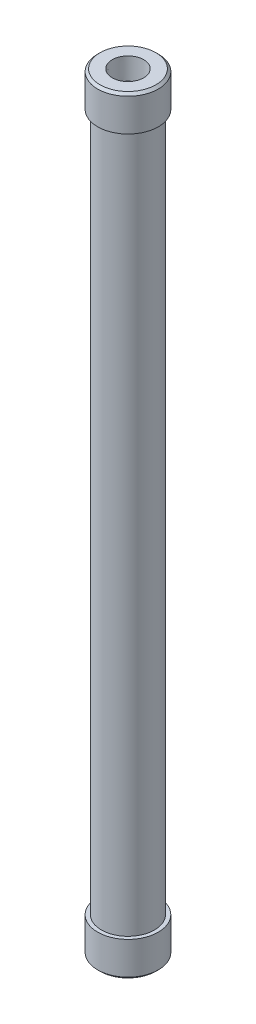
ISO-10303-21;
HEADER;
FILE_DESCRIPTION(('STEP AP214'),'2;1');
FILE_NAME('part.step','',(''),(''),'','','');
FILE_SCHEMA(('AUTOMOTIVE_DESIGN { 1 0 10303 214 1 1 1 1 }'));
ENDSEC;
DATA;
#1=APPLICATION_CONTEXT('core data for automotive mechanical design processes');
#2=APPLICATION_PROTOCOL_DEFINITION('international standard','automotive_design',2000,#1);
#3=PRODUCT_CONTEXT('',#1,'mechanical');
#4=PRODUCT('Part','Part','',(#3));
#5=PRODUCT_RELATED_PRODUCT_CATEGORY('part','',(#4));
#6=PRODUCT_DEFINITION_FORMATION('','',#4);
#7=PRODUCT_DEFINITION_CONTEXT('part definition',#1,'design');
#8=PRODUCT_DEFINITION('design','',#6,#7);
#9=PRODUCT_DEFINITION_SHAPE('','',#8);
#10=(LENGTH_UNIT() NAMED_UNIT(*) SI_UNIT(.MILLI.,.METRE.));
#11=(NAMED_UNIT(*) PLANE_ANGLE_UNIT() SI_UNIT($,.RADIAN.));
#12=(NAMED_UNIT(*) SI_UNIT($,.STERADIAN.) SOLID_ANGLE_UNIT());
#13=UNCERTAINTY_MEASURE_WITH_UNIT(LENGTH_MEASURE(1.E-05),#10,'distance_accuracy_value','');
#14=(GEOMETRIC_REPRESENTATION_CONTEXT(3) GLOBAL_UNCERTAINTY_ASSIGNED_CONTEXT((#13)) GLOBAL_UNIT_ASSIGNED_CONTEXT((#10,
#11,#12)) REPRESENTATION_CONTEXT('',''));
#15=CARTESIAN_POINT('',(0.,0.,0.));
#16=DIRECTION('',(0.,0.,1.));
#17=DIRECTION('',(1.,0.,0.));
#18=AXIS2_PLACEMENT_3D('',#15,#16,#17);
#19=CARTESIAN_POINT('',(0.,482.6,0.));
#20=DIRECTION('',(0.,-1.,0.));
#21=DIRECTION('',(0.,0.,-1.));
#22=AXIS2_PLACEMENT_3D('',#19,#20,#21);
#23=CYLINDRICAL_SURFACE('',#22,16.7005);
#24=CARTESIAN_POINT('',(0.,22.098,0.));
#25=DIRECTION('',(0.,1.,0.));
#26=DIRECTION('',(0.,0.,1.));
#27=AXIS2_PLACEMENT_3D('',#24,#25,#26);
#28=CIRCLE('',#27,16.7005);
#29=CARTESIAN_POINT('',(0.,22.0979999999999,-16.7005));
#30=VERTEX_POINT('',#29);
#31=EDGE_CURVE('E70',#30,#30,#28,.T.);
#32=CARTESIAN_POINT('',(0.,460.502,0.));
#33=DIRECTION('',(0.,1.,0.));
#34=DIRECTION('',(0.,0.,1.));
#35=AXIS2_PLACEMENT_3D('',#32,#33,#34);
#36=CIRCLE('',#35,16.7005);
#37=CARTESIAN_POINT('',(0.,460.502,-16.7005));
#38=VERTEX_POINT('',#37);
#39=EDGE_CURVE('E52',#38,#38,#36,.T.);
#40=CARTESIAN_POINT('',(0.,22.0979999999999,-16.7005));
#41=CARTESIAN_POINT('',(0.,26.6647083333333,-16.7005));
#42=CARTESIAN_POINT('',(0.,31.2314166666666,-16.7005));
#43=CARTESIAN_POINT('',(0.,40.3648333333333,-16.7005));
#44=CARTESIAN_POINT('',(0.,44.9315416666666,-16.7005));
#45=CARTESIAN_POINT('',(0.,54.0649583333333,-16.7005));
#46=CARTESIAN_POINT('',(0.,58.6316666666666,-16.7005));
#47=CARTESIAN_POINT('',(0.,67.7650833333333,-16.7005));
#48=CARTESIAN_POINT('',(0.,72.3317916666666,-16.7005));
#49=CARTESIAN_POINT('',(0.,81.4652083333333,-16.7005));
#50=CARTESIAN_POINT('',(0.,86.0319166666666,-16.7005));
#51=CARTESIAN_POINT('',(0.,95.1653333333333,-16.7005));
#52=CARTESIAN_POINT('',(0.,99.7320416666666,-16.7005));
#53=CARTESIAN_POINT('',(0.,108.865458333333,-16.7005));
#54=CARTESIAN_POINT('',(0.,113.432166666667,-16.7005));
#55=CARTESIAN_POINT('',(0.,122.565583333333,-16.7005));
#56=CARTESIAN_POINT('',(0.,127.132291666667,-16.7005));
#57=CARTESIAN_POINT('',(0.,136.265708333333,-16.7005));
#58=CARTESIAN_POINT('',(0.,140.832416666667,-16.7005));
#59=CARTESIAN_POINT('',(0.,149.965833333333,-16.7005));
#60=CARTESIAN_POINT('',(0.,154.532541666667,-16.7005));
#61=CARTESIAN_POINT('',(0.,163.665958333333,-16.7005));
#62=CARTESIAN_POINT('',(0.,168.232666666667,-16.7005));
#63=CARTESIAN_POINT('',(0.,177.366083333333,-16.7005));
#64=CARTESIAN_POINT('',(0.,181.932791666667,-16.7005));
#65=CARTESIAN_POINT('',(0.,191.066208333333,-16.7005));
#66=CARTESIAN_POINT('',(0.,195.632916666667,-16.7005));
#67=CARTESIAN_POINT('',(0.,204.766333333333,-16.7005));
#68=CARTESIAN_POINT('',(0.,209.333041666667,-16.7005));
#69=CARTESIAN_POINT('',(0.,218.466458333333,-16.7005));
#70=CARTESIAN_POINT('',(0.,223.033166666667,-16.7005));
#71=CARTESIAN_POINT('',(0.,232.166583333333,-16.7005));
#72=CARTESIAN_POINT('',(0.,236.733291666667,-16.7005));
#73=CARTESIAN_POINT('',(0.,245.866708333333,-16.7005));
#74=CARTESIAN_POINT('',(0.,250.433416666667,-16.7005));
#75=CARTESIAN_POINT('',(0.,259.566833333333,-16.7005));
#76=CARTESIAN_POINT('',(0.,264.133541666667,-16.7005));
#77=CARTESIAN_POINT('',(0.,273.266958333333,-16.7005));
#78=CARTESIAN_POINT('',(0.,277.833666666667,-16.7005));
#79=CARTESIAN_POINT('',(0.,286.967083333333,-16.7005));
#80=CARTESIAN_POINT('',(0.,291.533791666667,-16.7005));
#81=CARTESIAN_POINT('',(0.,300.667208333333,-16.7005));
#82=CARTESIAN_POINT('',(0.,305.233916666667,-16.7005));
#83=CARTESIAN_POINT('',(0.,314.367333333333,-16.7005));
#84=CARTESIAN_POINT('',(0.,318.934041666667,-16.7005));
#85=CARTESIAN_POINT('',(0.,328.067458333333,-16.7005));
#86=CARTESIAN_POINT('',(0.,332.634166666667,-16.7005));
#87=CARTESIAN_POINT('',(0.,341.767583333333,-16.7005));
#88=CARTESIAN_POINT('',(0.,346.334291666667,-16.7005));
#89=CARTESIAN_POINT('',(0.,355.467708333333,-16.7005));
#90=CARTESIAN_POINT('',(0.,360.034416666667,-16.7005));
#91=CARTESIAN_POINT('',(0.,369.167833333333,-16.7005));
#92=CARTESIAN_POINT('',(0.,373.734541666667,-16.7005));
#93=CARTESIAN_POINT('',(0.,382.867958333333,-16.7005));
#94=CARTESIAN_POINT('',(0.,387.434666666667,-16.7005));
#95=CARTESIAN_POINT('',(0.,396.568083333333,-16.7005));
#96=CARTESIAN_POINT('',(0.,401.134791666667,-16.7005));
#97=CARTESIAN_POINT('',(0.,410.268208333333,-16.7005));
#98=CARTESIAN_POINT('',(0.,414.834916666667,-16.7005));
#99=CARTESIAN_POINT('',(0.,423.968333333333,-16.7005));
#100=CARTESIAN_POINT('',(0.,428.535041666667,-16.7005));
#101=CARTESIAN_POINT('',(0.,437.668458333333,-16.7005));
#102=CARTESIAN_POINT('',(0.,442.235166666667,-16.7005));
#103=CARTESIAN_POINT('',(0.,451.368583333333,-16.7005));
#104=CARTESIAN_POINT('',(0.,455.935291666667,-16.7005));
#105=CARTESIAN_POINT('',(0.,460.502,-16.7005));
#106=B_SPLINE_CURVE_WITH_KNOTS('',3,(#40,#41,#42,#43,#44,#45,#46,#47,#48,#49,#50,#51,#52,#53,
#54,#55,#56,#57,#58,#59,#60,#61,#62,#63,#64,#65,#66,#67,#68,#69,#70,#71,#72,#73,#74,#75,#76,#77,
#78,#79,#80,#81,#82,#83,#84,#85,#86,#87,#88,#89,#90,#91,#92,#93,#94,#95,#96,#97,#98,#99,#100,
#101,#102,#103,#104,#105),.UNSPECIFIED.,.F.,.F.,(4,2,2,2,2,2,2,2,2,2,2,2,2,2,2,2,2,2,2,2,2,2,2,
2,2,2,2,2,2,2,2,2,4),(0.,13.700125,27.40025,41.100375,54.8005,68.500625,82.20075,95.900875,
109.601,123.301125,137.00125,150.701375,164.4015,178.101625,191.80175,205.501875,219.202,
232.902125,246.60225,260.302375,274.0025,287.702625,301.40275,315.102875,328.803,342.503125,
356.20325,369.903375,383.6035,397.303625,411.00375,424.703875,438.404),.UNSPECIFIED.);
#107=EDGE_CURVE('BSEAM32',#30,#38,#106,.T.);
#108=ORIENTED_EDGE('',*,*,#31,.T.);
#109=ORIENTED_EDGE('',*,*,#39,.F.);
#110=ORIENTED_EDGE('',*,*,#107,.T.);
#111=ORIENTED_EDGE('',*,*,#107,.F.);
#112=EDGE_LOOP('',(#108,#110,#109,#111));
#113=FACE_BOUND('',#112,.T.);
#114=ADVANCED_FACE('F32',(#113),#23,.T.);
#115=CARTESIAN_POINT('',(0.,22.098,0.));
#116=DIRECTION('',(0.,1.,0.));
#117=DIRECTION('',(0.,0.,1.));
#118=AXIS2_PLACEMENT_3D('',#115,#116,#117);
#119=PLANE('',#118);
#120=CARTESIAN_POINT('',(0.,22.098,0.));
#121=DIRECTION('',(0.,1.,0.));
#122=DIRECTION('',(0.,0.,1.));
#123=AXIS2_PLACEMENT_3D('',#120,#121,#122);
#124=CIRCLE('',#123,19.05);
#125=CARTESIAN_POINT('',(0.,22.098,19.05));
#126=VERTEX_POINT('',#125);
#127=EDGE_CURVE('E66',#126,#126,#124,.T.);
#128=ORIENTED_EDGE('',*,*,#127,.T.);
#129=EDGE_LOOP('',(#128));
#130=FACE_BOUND('',#129,.T.);
#131=ORIENTED_EDGE('',*,*,#31,.F.);
#132=EDGE_LOOP('',(#131));
#133=FACE_BOUND('',#132,.T.);
#134=ADVANCED_FACE('F114',(#130,#133),#119,.T.);
#135=CARTESIAN_POINT('',(0.,22.098,0.));
#136=DIRECTION('',(0.,-1.,0.));
#137=DIRECTION('',(0.,0.,-1.));
#138=AXIS2_PLACEMENT_3D('',#135,#136,#137);
#139=CYLINDRICAL_SURFACE('',#138,19.05);
#140=CARTESIAN_POINT('',(0.,1.52400000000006,0.));
#141=DIRECTION('',(0.,1.,0.));
#142=DIRECTION('',(0.,0.,1.));
#143=AXIS2_PLACEMENT_3D('',#140,#141,#142);
#144=CIRCLE('',#143,19.05);
#145=CARTESIAN_POINT('',(0.,1.52400000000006,19.05));
#146=VERTEX_POINT('',#145);
#147=EDGE_CURVE('E47',#146,#146,#144,.T.);
#148=ORIENTED_EDGE('',*,*,#147,.T.);
#149=EDGE_LOOP('',(#148));
#150=FACE_BOUND('',#149,.T.);
#151=ORIENTED_EDGE('',*,*,#127,.F.);
#152=EDGE_LOOP('',(#151));
#153=FACE_BOUND('',#152,.T.);
#154=ADVANCED_FACE('F120',(#150,#153),#139,.T.);
#155=CARTESIAN_POINT('',(0.,0.,0.));
#156=DIRECTION('',(0.,1.,0.));
#157=DIRECTION('',(0.,0.,1.));
#158=AXIS2_PLACEMENT_3D('',#155,#156,#157);
#159=PLANE('',#158);
#160=CARTESIAN_POINT('',(0.,0.,0.));
#161=DIRECTION('',(0.,1.,0.));
#162=DIRECTION('',(0.,0.,1.));
#163=AXIS2_PLACEMENT_3D('',#160,#161,#162);
#164=CIRCLE('',#163,17.5259999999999);
#165=CARTESIAN_POINT('',(0.,0.,17.5259999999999));
#166=VERTEX_POINT('',#165);
#167=EDGE_CURVE('E43',#166,#166,#164,.F.);
#168=ORIENTED_EDGE('',*,*,#167,.T.);
#169=EDGE_LOOP('',(#168));
#170=FACE_BOUND('',#169,.T.);
#171=CARTESIAN_POINT('',(0.,0.,0.));
#172=DIRECTION('',(0.,-1.,0.));
#173=DIRECTION('',(0.,0.,-1.));
#174=AXIS2_PLACEMENT_3D('',#171,#172,#173);
#175=CIRCLE('',#174,9.8827971);
#176=CARTESIAN_POINT('',(0.,0.,-9.8827971));
#177=VERTEX_POINT('',#176);
#178=EDGE_CURVE('E56',#177,#177,#175,.T.);
#179=ORIENTED_EDGE('',*,*,#178,.F.);
#180=EDGE_LOOP('',(#179));
#181=FACE_BOUND('',#180,.T.);
#182=ADVANCED_FACE('F125',(#170,#181),#159,.F.);
#183=CARTESIAN_POINT('',(0.,460.502,0.));
#184=DIRECTION('',(0.,1.,0.));
#185=DIRECTION('',(0.,0.,1.));
#186=AXIS2_PLACEMENT_3D('',#183,#184,#185);
#187=PLANE('',#186);
#188=CARTESIAN_POINT('',(0.,460.502,0.));
#189=DIRECTION('',(0.,1.,0.));
#190=DIRECTION('',(0.,0.,1.));
#191=AXIS2_PLACEMENT_3D('',#188,#189,#190);
#192=CIRCLE('',#191,19.05);
#193=CARTESIAN_POINT('',(0.,460.502,19.05));
#194=VERTEX_POINT('',#193);
#195=EDGE_CURVE('E61',#194,#194,#192,.T.);
#196=ORIENTED_EDGE('',*,*,#195,.F.);
#197=EDGE_LOOP('',(#196));
#198=FACE_BOUND('',#197,.T.);
#199=ORIENTED_EDGE('',*,*,#39,.T.);
#200=EDGE_LOOP('',(#199));
#201=FACE_BOUND('',#200,.T.);
#202=ADVANCED_FACE('F109',(#198,#201),#187,.F.);
#203=CARTESIAN_POINT('',(0.,460.502,0.));
#204=DIRECTION('',(0.,1.,0.));
#205=DIRECTION('',(0.,0.,1.));
#206=AXIS2_PLACEMENT_3D('',#203,#204,#205);
#207=CYLINDRICAL_SURFACE('',#206,19.05);
#208=CARTESIAN_POINT('',(0.,481.076,0.));
#209=DIRECTION('',(0.,1.,0.));
#210=DIRECTION('',(0.,0.,1.));
#211=AXIS2_PLACEMENT_3D('',#208,#209,#210);
#212=CIRCLE('',#211,19.05);
#213=CARTESIAN_POINT('',(0.,481.076,-19.05));
#214=VERTEX_POINT('',#213);
#215=EDGE_CURVE('E10',#214,#214,#212,.F.);
#216=ORIENTED_EDGE('',*,*,#215,.T.);
#217=EDGE_LOOP('',(#216));
#218=FACE_BOUND('',#217,.T.);
#219=ORIENTED_EDGE('',*,*,#195,.T.);
#220=EDGE_LOOP('',(#219));
#221=FACE_BOUND('',#220,.T.);
#222=ADVANCED_FACE('F100',(#218,#221),#207,.T.);
#223=CARTESIAN_POINT('',(0.,482.6,0.));
#224=DIRECTION('',(0.,1.,0.));
#225=DIRECTION('',(0.,0.,1.));
#226=AXIS2_PLACEMENT_3D('',#223,#224,#225);
#227=PLANE('',#226);
#228=CARTESIAN_POINT('',(0.,482.6,0.));
#229=DIRECTION('',(0.,1.,0.));
#230=DIRECTION('',(0.,0.,1.));
#231=AXIS2_PLACEMENT_3D('',#228,#229,#230);
#232=CIRCLE('',#231,17.526);
#233=CARTESIAN_POINT('',(0.,482.6,-17.526));
#234=VERTEX_POINT('',#233);
#235=EDGE_CURVE('E39',#234,#234,#232,.T.);
#236=ORIENTED_EDGE('',*,*,#235,.T.);
#237=EDGE_LOOP('',(#236));
#238=FACE_BOUND('',#237,.T.);
#239=CARTESIAN_POINT('',(0.,482.6,0.));
#240=DIRECTION('',(0.,1.,0.));
#241=DIRECTION('',(0.,0.,1.));
#242=AXIS2_PLACEMENT_3D('',#239,#240,#241);
#243=CIRCLE('',#242,9.8827971);
#244=CARTESIAN_POINT('',(0.,482.6,9.8827971));
#245=VERTEX_POINT('',#244);
#246=EDGE_CURVE('E91',#245,#245,#243,.T.);
#247=ORIENTED_EDGE('',*,*,#246,.F.);
#248=EDGE_LOOP('',(#247));
#249=FACE_BOUND('',#248,.T.);
#250=ADVANCED_FACE('F97',(#238,#249),#227,.T.);
#251=CARTESIAN_POINT('',(0.,0.,0.));
#252=DIRECTION('',(0.,-1.,0.));
#253=DIRECTION('',(0.,0.,-1.));
#254=AXIS2_PLACEMENT_3D('',#251,#252,#253);
#255=CYLINDRICAL_SURFACE('',#254,8.9281);
#256=CARTESIAN_POINT('',(0.,22.098,0.));
#257=DIRECTION('',(0.,1.,0.));
#258=DIRECTION('',(0.,0.,1.));
#259=AXIS2_PLACEMENT_3D('',#256,#257,#258);
#260=CIRCLE('',#259,8.9281);
#261=CARTESIAN_POINT('',(0.,22.098,8.9281));
#262=VERTEX_POINT('',#261);
#263=EDGE_CURVE('E58',#262,#262,#260,.T.);
#264=ORIENTED_EDGE('',*,*,#263,.T.);
#265=EDGE_LOOP('',(#264));
#266=FACE_BOUND('',#265,.T.);
#267=CARTESIAN_POINT('',(0.,13.462,0.));
#268=DIRECTION('',(0.,-1.,0.));
#269=DIRECTION('',(0.,0.,-1.));
#270=AXIS2_PLACEMENT_3D('',#267,#268,#269);
#271=CIRCLE('',#270,8.9281);
#272=CARTESIAN_POINT('',(0.,13.462,-8.9281));
#273=VERTEX_POINT('',#272);
#274=EDGE_CURVE('E62',#273,#273,#271,.T.);
#275=ORIENTED_EDGE('',*,*,#274,.T.);
#276=EDGE_LOOP('',(#275));
#277=FACE_BOUND('',#276,.T.);
#278=ADVANCED_FACE('F99',(#266,#277),#255,.F.);
#279=CARTESIAN_POINT('',(8.9281,13.462,0.));
#280=DIRECTION('',(0.,1.,0.));
#281=DIRECTION('',(0.,0.,1.));
#282=AXIS2_PLACEMENT_3D('',#279,#280,#281);
#283=PLANE('',#282);
#284=ORIENTED_EDGE('',*,*,#274,.F.);
#285=EDGE_LOOP('',(#284));
#286=FACE_BOUND('',#285,.T.);
#287=CARTESIAN_POINT('',(0.,13.462,0.));
#288=DIRECTION('',(0.,-1.,0.));
#289=DIRECTION('',(0.,0.,-1.));
#290=AXIS2_PLACEMENT_3D('',#287,#288,#289);
#291=CIRCLE('',#290,9.47972679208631);
#292=CARTESIAN_POINT('',(0.,13.462,-9.47972679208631));
#293=VERTEX_POINT('',#292);
#294=EDGE_CURVE('E81',#293,#293,#291,.T.);
#295=ORIENTED_EDGE('',*,*,#294,.T.);
#296=EDGE_LOOP('',(#295));
#297=FACE_BOUND('',#296,.T.);
#298=ADVANCED_FACE('F106',(#286,#297),#283,.F.);
#299=CARTESIAN_POINT('',(0.,0.,0.));
#300=DIRECTION('',(0.,-1.,0.));
#301=DIRECTION('',(0.,0.,-1.));
#302=AXIS2_PLACEMENT_3D('',#299,#300,#301);
#303=CONICAL_SURFACE('',#302,9.8827971,0.0299323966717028);
#304=ORIENTED_EDGE('',*,*,#294,.F.);
#305=EDGE_LOOP('',(#304));
#306=FACE_BOUND('',#305,.T.);
#307=ORIENTED_EDGE('',*,*,#178,.T.);
#308=EDGE_LOOP('',(#307));
#309=FACE_BOUND('',#308,.T.);
#310=ADVANCED_FACE('F162',(#306,#309),#303,.F.);
#311=ORIENTED_EDGE('',*,*,#263,.F.);
#312=EDGE_LOOP('',(#311));
#313=FACE_BOUND('',#312,.T.);
#314=CARTESIAN_POINT('',(0.,22.098,0.));
#315=DIRECTION('',(0.,1.,0.));
#316=DIRECTION('',(0.,0.,1.));
#317=AXIS2_PLACEMENT_3D('',#314,#315,#316);
#318=CIRCLE('',#317,13.1445);
#319=CARTESIAN_POINT('',(0.,22.0979999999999,-13.1445));
#320=VERTEX_POINT('',#319);
#321=EDGE_CURVE('E67',#320,#320,#318,.T.);
#322=ORIENTED_EDGE('',*,*,#321,.T.);
#323=EDGE_LOOP('',(#322));
#324=FACE_BOUND('',#323,.T.);
#325=ADVANCED_FACE('F123',(#313,#324),#119,.T.);
#326=CARTESIAN_POINT('',(0.,482.6,0.));
#327=DIRECTION('',(0.,-1.,0.));
#328=DIRECTION('',(0.,0.,-1.));
#329=AXIS2_PLACEMENT_3D('',#326,#327,#328);
#330=CYLINDRICAL_SURFACE('',#329,13.1445);
#331=CARTESIAN_POINT('',(0.,460.502,0.));
#332=DIRECTION('',(0.,1.,0.));
#333=DIRECTION('',(0.,0.,1.));
#334=AXIS2_PLACEMENT_3D('',#331,#332,#333);
#335=CIRCLE('',#334,13.1445);
#336=CARTESIAN_POINT('',(0.,460.502,-13.1445));
#337=VERTEX_POINT('',#336);
#338=EDGE_CURVE('E63',#337,#337,#335,.T.);
#339=CARTESIAN_POINT('',(0.,22.0979999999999,-13.1445));
#340=CARTESIAN_POINT('',(0.,26.6647083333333,-13.1445));
#341=CARTESIAN_POINT('',(0.,31.2314166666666,-13.1445));
#342=CARTESIAN_POINT('',(0.,40.3648333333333,-13.1445));
#343=CARTESIAN_POINT('',(0.,44.9315416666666,-13.1445));
#344=CARTESIAN_POINT('',(0.,54.0649583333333,-13.1445));
#345=CARTESIAN_POINT('',(0.,58.6316666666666,-13.1445));
#346=CARTESIAN_POINT('',(0.,67.7650833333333,-13.1445));
#347=CARTESIAN_POINT('',(0.,72.3317916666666,-13.1445));
#348=CARTESIAN_POINT('',(0.,81.4652083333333,-13.1445));
#349=CARTESIAN_POINT('',(0.,86.0319166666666,-13.1445));
#350=CARTESIAN_POINT('',(0.,95.1653333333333,-13.1445));
#351=CARTESIAN_POINT('',(0.,99.7320416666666,-13.1445));
#352=CARTESIAN_POINT('',(0.,108.865458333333,-13.1445));
#353=CARTESIAN_POINT('',(0.,113.432166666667,-13.1445));
#354=CARTESIAN_POINT('',(0.,122.565583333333,-13.1445));
#355=CARTESIAN_POINT('',(0.,127.132291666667,-13.1445));
#356=CARTESIAN_POINT('',(0.,136.265708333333,-13.1445));
#357=CARTESIAN_POINT('',(0.,140.832416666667,-13.1445));
#358=CARTESIAN_POINT('',(0.,149.965833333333,-13.1445));
#359=CARTESIAN_POINT('',(0.,154.532541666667,-13.1445));
#360=CARTESIAN_POINT('',(0.,163.665958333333,-13.1445));
#361=CARTESIAN_POINT('',(0.,168.232666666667,-13.1445));
#362=CARTESIAN_POINT('',(0.,177.366083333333,-13.1445));
#363=CARTESIAN_POINT('',(0.,181.932791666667,-13.1445));
#364=CARTESIAN_POINT('',(0.,191.066208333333,-13.1445));
#365=CARTESIAN_POINT('',(0.,195.632916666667,-13.1445));
#366=CARTESIAN_POINT('',(0.,204.766333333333,-13.1445));
#367=CARTESIAN_POINT('',(0.,209.333041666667,-13.1445));
#368=CARTESIAN_POINT('',(0.,218.466458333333,-13.1445));
#369=CARTESIAN_POINT('',(0.,223.033166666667,-13.1445));
#370=CARTESIAN_POINT('',(0.,232.166583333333,-13.1445));
#371=CARTESIAN_POINT('',(0.,236.733291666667,-13.1445));
#372=CARTESIAN_POINT('',(0.,245.866708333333,-13.1445));
#373=CARTESIAN_POINT('',(0.,250.433416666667,-13.1445));
#374=CARTESIAN_POINT('',(0.,259.566833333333,-13.1445));
#375=CARTESIAN_POINT('',(0.,264.133541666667,-13.1445));
#376=CARTESIAN_POINT('',(0.,273.266958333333,-13.1445));
#377=CARTESIAN_POINT('',(0.,277.833666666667,-13.1445));
#378=CARTESIAN_POINT('',(0.,286.967083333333,-13.1445));
#379=CARTESIAN_POINT('',(0.,291.533791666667,-13.1445));
#380=CARTESIAN_POINT('',(0.,300.667208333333,-13.1445));
#381=CARTESIAN_POINT('',(0.,305.233916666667,-13.1445));
#382=CARTESIAN_POINT('',(0.,314.367333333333,-13.1445));
#383=CARTESIAN_POINT('',(0.,318.934041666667,-13.1445));
#384=CARTESIAN_POINT('',(0.,328.067458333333,-13.1445));
#385=CARTESIAN_POINT('',(0.,332.634166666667,-13.1445));
#386=CARTESIAN_POINT('',(0.,341.767583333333,-13.1445));
#387=CARTESIAN_POINT('',(0.,346.334291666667,-13.1445));
#388=CARTESIAN_POINT('',(0.,355.467708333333,-13.1445));
#389=CARTESIAN_POINT('',(0.,360.034416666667,-13.1445));
#390=CARTESIAN_POINT('',(0.,369.167833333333,-13.1445));
#391=CARTESIAN_POINT('',(0.,373.734541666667,-13.1445));
#392=CARTESIAN_POINT('',(0.,382.867958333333,-13.1445));
#393=CARTESIAN_POINT('',(0.,387.434666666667,-13.1445));
#394=CARTESIAN_POINT('',(0.,396.568083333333,-13.1445));
#395=CARTESIAN_POINT('',(0.,401.134791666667,-13.1445));
#396=CARTESIAN_POINT('',(0.,410.268208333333,-13.1445));
#397=CARTESIAN_POINT('',(0.,414.834916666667,-13.1445));
#398=CARTESIAN_POINT('',(0.,423.968333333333,-13.1445));
#399=CARTESIAN_POINT('',(0.,428.535041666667,-13.1445));
#400=CARTESIAN_POINT('',(0.,437.668458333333,-13.1445));
#401=CARTESIAN_POINT('',(0.,442.235166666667,-13.1445));
#402=CARTESIAN_POINT('',(0.,451.368583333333,-13.1445));
#403=CARTESIAN_POINT('',(0.,455.935291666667,-13.1445));
#404=CARTESIAN_POINT('',(0.,460.502,-13.1445));
#405=B_SPLINE_CURVE_WITH_KNOTS('',3,(#339,#340,#341,#342,#343,#344,#345,#346,#347,#348,#349,
#350,#351,#352,#353,#354,#355,#356,#357,#358,#359,#360,#361,#362,#363,#364,#365,#366,#367,#368,
#369,#370,#371,#372,#373,#374,#375,#376,#377,#378,#379,#380,#381,#382,#383,#384,#385,#386,#387,
#388,#389,#390,#391,#392,#393,#394,#395,#396,#397,#398,#399,#400,#401,#402,#403,#404),
.UNSPECIFIED.,.F.,.F.,(4,2,2,2,2,2,2,2,2,2,2,2,2,2,2,2,2,2,2,2,2,2,2,2,2,2,2,2,2,2,2,2,4),(0.,
13.700125,27.40025,41.100375,54.8005,68.500625,82.20075,95.900875,109.601,123.301125,137.00125,
150.701375,164.4015,178.101625,191.80175,205.501875,219.202,232.902125,246.60225,260.302375,
274.0025,287.702625,301.40275,315.102875,328.803,342.503125,356.20325,369.903375,383.6035,
397.303625,411.00375,424.703875,438.404),.UNSPECIFIED.);
#406=EDGE_CURVE('BSEAM151',#320,#337,#405,.T.);
#407=ORIENTED_EDGE('',*,*,#321,.F.);
#408=ORIENTED_EDGE('',*,*,#338,.T.);
#409=ORIENTED_EDGE('',*,*,#406,.T.);
#410=ORIENTED_EDGE('',*,*,#406,.F.);
#411=EDGE_LOOP('',(#407,#409,#408,#410));
#412=FACE_BOUND('',#411,.T.);
#413=ADVANCED_FACE('F151',(#412),#330,.F.);
#414=CARTESIAN_POINT('',(0.,460.502,0.));
#415=DIRECTION('',(0.,1.,0.));
#416=DIRECTION('',(0.,0.,1.));
#417=AXIS2_PLACEMENT_3D('',#414,#415,#416);
#418=CIRCLE('',#417,8.92810000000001);
#419=CARTESIAN_POINT('',(0.,460.502,8.92810000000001));
#420=VERTEX_POINT('',#419);
#421=EDGE_CURVE('E53',#420,#420,#418,.T.);
#422=ORIENTED_EDGE('',*,*,#421,.T.);
#423=EDGE_LOOP('',(#422));
#424=FACE_BOUND('',#423,.T.);
#425=ORIENTED_EDGE('',*,*,#338,.F.);
#426=EDGE_LOOP('',(#425));
#427=FACE_BOUND('',#426,.T.);
#428=ADVANCED_FACE('F153',(#424,#427),#187,.F.);
#429=CARTESIAN_POINT('',(0.,482.6,0.));
#430=DIRECTION('',(0.,1.,0.));
#431=DIRECTION('',(0.,0.,1.));
#432=AXIS2_PLACEMENT_3D('',#429,#430,#431);
#433=CYLINDRICAL_SURFACE('',#432,8.92810000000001);
#434=CARTESIAN_POINT('',(0.,469.138,0.));
#435=DIRECTION('',(0.,1.,0.));
#436=DIRECTION('',(0.,0.,1.));
#437=AXIS2_PLACEMENT_3D('',#434,#435,#436);
#438=CIRCLE('',#437,8.92810000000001);
#439=CARTESIAN_POINT('',(0.,469.138,8.92810000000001));
#440=VERTEX_POINT('',#439);
#441=EDGE_CURVE('E57',#440,#440,#438,.T.);
#442=ORIENTED_EDGE('',*,*,#441,.T.);
#443=EDGE_LOOP('',(#442));
#444=FACE_BOUND('',#443,.T.);
#445=ORIENTED_EDGE('',*,*,#421,.F.);
#446=EDGE_LOOP('',(#445));
#447=FACE_BOUND('',#446,.T.);
#448=ADVANCED_FACE('F159',(#444,#447),#433,.F.);
#449=CARTESIAN_POINT('',(8.92810000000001,469.138,0.));
#450=DIRECTION('',(0.,-1.,0.));
#451=DIRECTION('',(0.,0.,-1.));
#452=AXIS2_PLACEMENT_3D('',#449,#450,#451);
#453=PLANE('',#452);
#454=ORIENTED_EDGE('',*,*,#441,.F.);
#455=EDGE_LOOP('',(#454));
#456=FACE_BOUND('',#455,.T.);
#457=CARTESIAN_POINT('',(0.,469.138,0.));
#458=DIRECTION('',(0.,1.,0.));
#459=DIRECTION('',(0.,0.,1.));
#460=AXIS2_PLACEMENT_3D('',#457,#458,#459);
#461=CIRCLE('',#460,9.47972679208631);
#462=CARTESIAN_POINT('',(0.,469.138,9.47972679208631));
#463=VERTEX_POINT('',#462);
#464=EDGE_CURVE('E88',#463,#463,#461,.T.);
#465=ORIENTED_EDGE('',*,*,#464,.T.);
#466=EDGE_LOOP('',(#465));
#467=FACE_BOUND('',#466,.T.);
#468=ADVANCED_FACE('F134',(#456,#467),#453,.F.);
#469=CARTESIAN_POINT('',(0.,482.6,0.));
#470=DIRECTION('',(0.,1.,0.));
#471=DIRECTION('',(0.,0.,1.));
#472=AXIS2_PLACEMENT_3D('',#469,#470,#471);
#473=CONICAL_SURFACE('',#472,9.8827971,0.0299323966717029);
#474=ORIENTED_EDGE('',*,*,#464,.F.);
#475=EDGE_LOOP('',(#474));
#476=FACE_BOUND('',#475,.T.);
#477=ORIENTED_EDGE('',*,*,#246,.T.);
#478=EDGE_LOOP('',(#477));
#479=FACE_BOUND('',#478,.T.);
#480=ADVANCED_FACE('F95',(#476,#479),#473,.F.);
#481=CARTESIAN_POINT('',(0.,1.52400000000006,0.));
#482=DIRECTION('',(0.,1.,0.));
#483=DIRECTION('',(0.,0.,1.));
#484=AXIS2_PLACEMENT_3D('',#481,#482,#483);
#485=CONICAL_SURFACE('',#484,19.05,0.785398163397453);
#486=ORIENTED_EDGE('',*,*,#167,.F.);
#487=EDGE_LOOP('',(#486));
#488=FACE_BOUND('',#487,.T.);
#489=ORIENTED_EDGE('',*,*,#147,.F.);
#490=EDGE_LOOP('',(#489));
#491=FACE_BOUND('',#490,.T.);
#492=ADVANCED_FACE('F126',(#488,#491),#485,.T.);
#493=CARTESIAN_POINT('',(0.,482.6,0.));
#494=DIRECTION('',(0.,-1.,0.));
#495=DIRECTION('',(0.,0.,-1.));
#496=AXIS2_PLACEMENT_3D('',#493,#494,#495);
#497=CONICAL_SURFACE('',#496,17.526,0.785398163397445);
#498=CARTESIAN_POINT('',(0.,481.076,-19.05));
#499=CARTESIAN_POINT('',(0.,481.091875,-19.034125));
#500=CARTESIAN_POINT('',(0.,481.10775,-19.01825));
#501=CARTESIAN_POINT('',(0.,481.1395,-18.9865));
#502=CARTESIAN_POINT('',(0.,481.155375,-18.970625));
#503=CARTESIAN_POINT('',(0.,481.187125,-18.938875));
#504=CARTESIAN_POINT('',(0.,481.203,-18.923));
#505=CARTESIAN_POINT('',(0.,481.23475,-18.89125));
#506=CARTESIAN_POINT('',(0.,481.250625,-18.875375));
#507=CARTESIAN_POINT('',(0.,481.282375,-18.843625));
#508=CARTESIAN_POINT('',(0.,481.29825,-18.82775));
#509=CARTESIAN_POINT('',(0.,481.33,-18.796));
#510=CARTESIAN_POINT('',(0.,481.345875,-18.780125));
#511=CARTESIAN_POINT('',(0.,481.377625,-18.748375));
#512=CARTESIAN_POINT('',(0.,481.3935,-18.7325));
#513=CARTESIAN_POINT('',(0.,481.42525,-18.70075));
#514=CARTESIAN_POINT('',(0.,481.441125,-18.684875));
#515=CARTESIAN_POINT('',(0.,481.472875,-18.653125));
#516=CARTESIAN_POINT('',(0.,481.48875,-18.63725));
#517=CARTESIAN_POINT('',(0.,481.5205,-18.6055));
#518=CARTESIAN_POINT('',(0.,481.536375,-18.589625));
#519=CARTESIAN_POINT('',(0.,481.568125,-18.557875));
#520=CARTESIAN_POINT('',(0.,481.584,-18.542));
#521=CARTESIAN_POINT('',(0.,481.61575,-18.51025));
#522=CARTESIAN_POINT('',(0.,481.631625,-18.494375));
#523=CARTESIAN_POINT('',(0.,481.663375,-18.462625));
#524=CARTESIAN_POINT('',(0.,481.67925,-18.44675));
#525=CARTESIAN_POINT('',(0.,481.711,-18.415));
#526=CARTESIAN_POINT('',(0.,481.726875,-18.399125));
#527=CARTESIAN_POINT('',(0.,481.758625,-18.367375));
#528=CARTESIAN_POINT('',(0.,481.7745,-18.3515));
#529=CARTESIAN_POINT('',(0.,481.80625,-18.31975));
#530=CARTESIAN_POINT('',(0.,481.822125,-18.303875));
#531=CARTESIAN_POINT('',(0.,481.853875,-18.272125));
#532=CARTESIAN_POINT('',(0.,481.86975,-18.25625));
#533=CARTESIAN_POINT('',(0.,481.9015,-18.2245));
#534=CARTESIAN_POINT('',(0.,481.917375,-18.208625));
#535=CARTESIAN_POINT('',(0.,481.949125,-18.176875));
#536=CARTESIAN_POINT('',(0.,481.965,-18.161));
#537=CARTESIAN_POINT('',(0.,481.99675,-18.12925));
#538=CARTESIAN_POINT('',(0.,482.012625,-18.113375));
#539=CARTESIAN_POINT('',(0.,482.044375,-18.081625));
#540=CARTESIAN_POINT('',(0.,482.06025,-18.06575));
#541=CARTESIAN_POINT('',(0.,482.092,-18.034));
#542=CARTESIAN_POINT('',(0.,482.107875,-18.018125));
#543=CARTESIAN_POINT('',(0.,482.139625,-17.986375));
#544=CARTESIAN_POINT('',(0.,482.1555,-17.9705));
#545=CARTESIAN_POINT('',(0.,482.18725,-17.93875));
#546=CARTESIAN_POINT('',(0.,482.203125,-17.922875));
#547=CARTESIAN_POINT('',(0.,482.234875,-17.891125));
#548=CARTESIAN_POINT('',(0.,482.25075,-17.87525));
#549=CARTESIAN_POINT('',(0.,482.2825,-17.8435));
#550=CARTESIAN_POINT('',(0.,482.298375,-17.827625));
#551=CARTESIAN_POINT('',(0.,482.330125,-17.795875));
#552=CARTESIAN_POINT('',(0.,482.346,-17.78));
#553=CARTESIAN_POINT('',(0.,482.37775,-17.74825));
#554=CARTESIAN_POINT('',(0.,482.393625,-17.732375));
#555=CARTESIAN_POINT('',(0.,482.425375,-17.700625));
#556=CARTESIAN_POINT('',(0.,482.44125,-17.68475));
#557=CARTESIAN_POINT('',(0.,482.473,-17.653));
#558=CARTESIAN_POINT('',(0.,482.488875,-17.637125));
#559=CARTESIAN_POINT('',(0.,482.520625,-17.605375));
#560=CARTESIAN_POINT('',(0.,482.5365,-17.5895));
#561=CARTESIAN_POINT('',(0.,482.56825,-17.55775));
#562=CARTESIAN_POINT('',(0.,482.584125,-17.541875));
#563=CARTESIAN_POINT('',(0.,482.6,-17.526));
#564=B_SPLINE_CURVE_WITH_KNOTS('',3,(#498,#499,#500,#501,#502,#503,#504,#505,#506,#507,#508,
#509,#510,#511,#512,#513,#514,#515,#516,#517,#518,#519,#520,#521,#522,#523,#524,#525,#526,#527,
#528,#529,#530,#531,#532,#533,#534,#535,#536,#537,#538,#539,#540,#541,#542,#543,#544,#545,#546,
#547,#548,#549,#550,#551,#552,#553,#554,#555,#556,#557,#558,#559,#560,#561,#562,#563),
.UNSPECIFIED.,.F.,.F.,(4,2,2,2,2,2,2,2,2,2,2,2,2,2,2,2,2,2,2,2,2,2,2,2,2,2,2,2,2,2,2,2,4),(0.,
0.0673519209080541,0.134703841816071,0.202055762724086,0.269407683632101,0.336759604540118,
0.404111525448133,0.471463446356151,0.538815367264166,0.606167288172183,0.673519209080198,
0.740871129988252,0.808223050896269,0.875574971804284,0.942926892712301,1.01027881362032,
1.07763073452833,1.14498265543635,1.21233457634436,1.27968649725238,1.3470384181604,
1.41439033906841,1.48174225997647,1.54909418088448,1.6164461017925,1.68379802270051,
1.75114994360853,1.81850186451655,1.88585378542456,1.95320570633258,2.02055762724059,
2.08790954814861,2.15526146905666),.UNSPECIFIED.);
#565=EDGE_CURVE('BSEAM34',#214,#234,#564,.T.);
#566=ORIENTED_EDGE('',*,*,#215,.F.);
#567=ORIENTED_EDGE('',*,*,#235,.F.);
#568=ORIENTED_EDGE('',*,*,#565,.T.);
#569=ORIENTED_EDGE('',*,*,#565,.F.);
#570=EDGE_LOOP('',(#566,#568,#567,#569));
#571=FACE_BOUND('',#570,.T.);
#572=ADVANCED_FACE('F34',(#571),#497,.T.);
#573=CLOSED_SHELL('',(#114,#134,#154,#182,#202,#222,#250,#278,#298,#310,#325,#413,#428,#448,
#468,#480,#492,#572));
#574=MANIFOLD_SOLID_BREP('B2',#573);
#575=ADVANCED_BREP_SHAPE_REPRESENTATION('',(#18,#574),#14);
#576=SHAPE_DEFINITION_REPRESENTATION(#9,#575);
ENDSEC;
END-ISO-10303-21;
